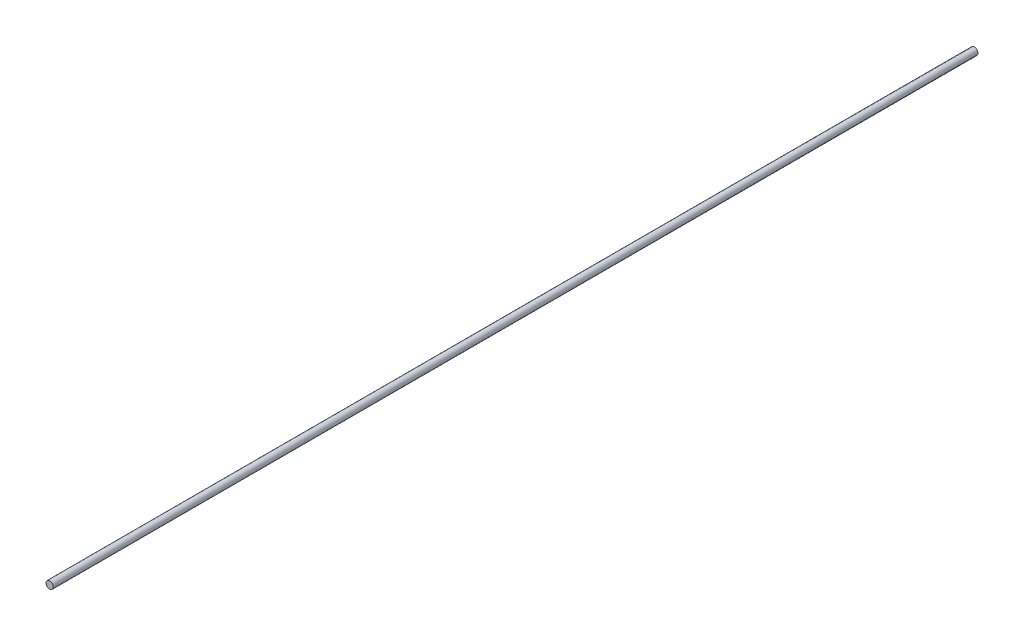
ISO-10303-21;
HEADER;
FILE_DESCRIPTION(('STEP AP214'),'2;1');
FILE_NAME('part.step','',(''),(''),'','','');
FILE_SCHEMA(('AUTOMOTIVE_DESIGN { 1 0 10303 214 1 1 1 1 }'));
ENDSEC;
DATA;
#1=APPLICATION_CONTEXT('core data for automotive mechanical design processes');
#2=APPLICATION_PROTOCOL_DEFINITION('international standard','automotive_design',2000,#1);
#3=PRODUCT_CONTEXT('',#1,'mechanical');
#4=PRODUCT('Part','Part','',(#3));
#5=PRODUCT_RELATED_PRODUCT_CATEGORY('part','',(#4));
#6=PRODUCT_DEFINITION_FORMATION('','',#4);
#7=PRODUCT_DEFINITION_CONTEXT('part definition',#1,'design');
#8=PRODUCT_DEFINITION('design','',#6,#7);
#9=PRODUCT_DEFINITION_SHAPE('','',#8);
#10=(LENGTH_UNIT() NAMED_UNIT(*) SI_UNIT(.MILLI.,.METRE.));
#11=(NAMED_UNIT(*) PLANE_ANGLE_UNIT() SI_UNIT($,.RADIAN.));
#12=(NAMED_UNIT(*) SI_UNIT($,.STERADIAN.) SOLID_ANGLE_UNIT());
#13=UNCERTAINTY_MEASURE_WITH_UNIT(LENGTH_MEASURE(1.E-05),#10,'distance_accuracy_value','');
#14=(GEOMETRIC_REPRESENTATION_CONTEXT(3) GLOBAL_UNCERTAINTY_ASSIGNED_CONTEXT((#13)) GLOBAL_UNIT_ASSIGNED_CONTEXT((#10,
#11,#12)) REPRESENTATION_CONTEXT('',''));
#15=CARTESIAN_POINT('',(0.,0.,0.));
#16=DIRECTION('',(0.,0.,1.));
#17=DIRECTION('',(1.,0.,0.));
#18=AXIS2_PLACEMENT_3D('',#15,#16,#17);
#19=CARTESIAN_POINT('',(0.,0.,1219.2));
#20=DIRECTION('',(0.,0.,-1.));
#21=DIRECTION('',(-1.,0.,0.));
#22=AXIS2_PLACEMENT_3D('',#19,#20,#21);
#23=CYLINDRICAL_SURFACE('',#22,4.7625);
#24=CARTESIAN_POINT('',(0.,0.,1219.2));
#25=DIRECTION('',(0.,0.,1.));
#26=DIRECTION('',(1.,0.,0.));
#27=AXIS2_PLACEMENT_3D('',#24,#25,#26);
#28=CIRCLE('',#27,4.7625);
#29=CARTESIAN_POINT('',(-4.7625,0.,1219.2));
#30=VERTEX_POINT('',#29);
#31=EDGE_CURVE('E12',#30,#30,#28,.T.);
#32=CARTESIAN_POINT('',(0.,0.,0.));
#33=DIRECTION('',(0.,0.,1.));
#34=DIRECTION('',(1.,0.,0.));
#35=AXIS2_PLACEMENT_3D('',#32,#33,#34);
#36=CIRCLE('',#35,4.7625);
#37=CARTESIAN_POINT('',(-4.7625,0.,0.));
#38=VERTEX_POINT('',#37);
#39=EDGE_CURVE('E43',#38,#38,#36,.T.);
#40=CARTESIAN_POINT('',(-4.7625,0.,1219.2));
#41=CARTESIAN_POINT('',(-4.7625,0.,1206.5));
#42=CARTESIAN_POINT('',(-4.7625,0.,1193.8));
#43=CARTESIAN_POINT('',(-4.7625,0.,1168.4));
#44=CARTESIAN_POINT('',(-4.7625,0.,1155.7));
#45=CARTESIAN_POINT('',(-4.7625,0.,1130.3));
#46=CARTESIAN_POINT('',(-4.7625,0.,1117.6));
#47=CARTESIAN_POINT('',(-4.7625,0.,1092.2));
#48=CARTESIAN_POINT('',(-4.7625,0.,1079.5));
#49=CARTESIAN_POINT('',(-4.7625,0.,1054.1));
#50=CARTESIAN_POINT('',(-4.7625,0.,1041.4));
#51=CARTESIAN_POINT('',(-4.7625,0.,1016.));
#52=CARTESIAN_POINT('',(-4.7625,0.,1003.3));
#53=CARTESIAN_POINT('',(-4.7625,0.,977.9));
#54=CARTESIAN_POINT('',(-4.7625,0.,965.2));
#55=CARTESIAN_POINT('',(-4.7625,0.,939.8));
#56=CARTESIAN_POINT('',(-4.7625,0.,927.1));
#57=CARTESIAN_POINT('',(-4.7625,0.,901.7));
#58=CARTESIAN_POINT('',(-4.7625,0.,889.));
#59=CARTESIAN_POINT('',(-4.7625,0.,863.6));
#60=CARTESIAN_POINT('',(-4.7625,0.,850.9));
#61=CARTESIAN_POINT('',(-4.7625,0.,825.5));
#62=CARTESIAN_POINT('',(-4.7625,0.,812.8));
#63=CARTESIAN_POINT('',(-4.7625,0.,787.4));
#64=CARTESIAN_POINT('',(-4.7625,0.,774.7));
#65=CARTESIAN_POINT('',(-4.7625,0.,749.3));
#66=CARTESIAN_POINT('',(-4.7625,0.,736.6));
#67=CARTESIAN_POINT('',(-4.7625,0.,711.2));
#68=CARTESIAN_POINT('',(-4.7625,0.,698.5));
#69=CARTESIAN_POINT('',(-4.7625,0.,673.1));
#70=CARTESIAN_POINT('',(-4.7625,0.,660.4));
#71=CARTESIAN_POINT('',(-4.7625,0.,635.));
#72=CARTESIAN_POINT('',(-4.7625,0.,622.3));
#73=CARTESIAN_POINT('',(-4.7625,0.,596.9));
#74=CARTESIAN_POINT('',(-4.7625,0.,584.2));
#75=CARTESIAN_POINT('',(-4.7625,0.,558.8));
#76=CARTESIAN_POINT('',(-4.7625,0.,546.1));
#77=CARTESIAN_POINT('',(-4.7625,0.,520.7));
#78=CARTESIAN_POINT('',(-4.7625,0.,508.));
#79=CARTESIAN_POINT('',(-4.7625,0.,482.6));
#80=CARTESIAN_POINT('',(-4.7625,0.,469.9));
#81=CARTESIAN_POINT('',(-4.7625,0.,444.5));
#82=CARTESIAN_POINT('',(-4.7625,0.,431.8));
#83=CARTESIAN_POINT('',(-4.7625,0.,406.4));
#84=CARTESIAN_POINT('',(-4.7625,0.,393.7));
#85=CARTESIAN_POINT('',(-4.7625,0.,368.3));
#86=CARTESIAN_POINT('',(-4.7625,0.,355.6));
#87=CARTESIAN_POINT('',(-4.7625,0.,330.2));
#88=CARTESIAN_POINT('',(-4.7625,0.,317.5));
#89=CARTESIAN_POINT('',(-4.7625,0.,292.1));
#90=CARTESIAN_POINT('',(-4.7625,0.,279.4));
#91=CARTESIAN_POINT('',(-4.7625,0.,254.));
#92=CARTESIAN_POINT('',(-4.7625,0.,241.3));
#93=CARTESIAN_POINT('',(-4.7625,0.,215.9));
#94=CARTESIAN_POINT('',(-4.7625,0.,203.2));
#95=CARTESIAN_POINT('',(-4.7625,0.,177.8));
#96=CARTESIAN_POINT('',(-4.7625,0.,165.1));
#97=CARTESIAN_POINT('',(-4.7625,0.,139.7));
#98=CARTESIAN_POINT('',(-4.7625,0.,127.));
#99=CARTESIAN_POINT('',(-4.7625,0.,101.6));
#100=CARTESIAN_POINT('',(-4.7625,0.,88.9));
#101=CARTESIAN_POINT('',(-4.7625,0.,63.5));
#102=CARTESIAN_POINT('',(-4.7625,0.,50.8));
#103=CARTESIAN_POINT('',(-4.7625,0.,25.4));
#104=CARTESIAN_POINT('',(-4.7625,0.,12.7));
#105=CARTESIAN_POINT('',(-4.7625,0.,0.));
#106=B_SPLINE_CURVE_WITH_KNOTS('',3,(#40,#41,#42,#43,#44,#45,#46,#47,#48,#49,#50,#51,#52,#53,
#54,#55,#56,#57,#58,#59,#60,#61,#62,#63,#64,#65,#66,#67,#68,#69,#70,#71,#72,#73,#74,#75,#76,#77,
#78,#79,#80,#81,#82,#83,#84,#85,#86,#87,#88,#89,#90,#91,#92,#93,#94,#95,#96,#97,#98,#99,#100,
#101,#102,#103,#104,#105),.UNSPECIFIED.,.F.,.F.,(4,2,2,2,2,2,2,2,2,2,2,2,2,2,2,2,2,2,2,2,2,2,2,
2,2,2,2,2,2,2,2,2,4),(0.,38.1,76.2,114.3,152.4,190.5,228.6,266.7,304.8,342.9,381.,419.1,457.2,
495.3,533.4,571.5,609.6,647.7,685.8,723.9,762.,800.1,838.2,876.3,914.4,952.5,990.6,1028.7,
1066.8,1104.9,1143.,1181.1,1219.2),.UNSPECIFIED.);
#107=EDGE_CURVE('BSEAM40',#30,#38,#106,.T.);
#108=ORIENTED_EDGE('',*,*,#31,.F.);
#109=ORIENTED_EDGE('',*,*,#39,.T.);
#110=ORIENTED_EDGE('',*,*,#107,.T.);
#111=ORIENTED_EDGE('',*,*,#107,.F.);
#112=EDGE_LOOP('',(#108,#110,#109,#111));
#113=FACE_BOUND('',#112,.T.);
#114=ADVANCED_FACE('F40',(#113),#23,.T.);
#115=CARTESIAN_POINT('',(0.,0.,1219.2));
#116=DIRECTION('',(0.,0.,1.));
#117=DIRECTION('',(1.,0.,0.));
#118=AXIS2_PLACEMENT_3D('',#115,#116,#117);
#119=PLANE('',#118);
#120=ORIENTED_EDGE('',*,*,#31,.T.);
#121=EDGE_LOOP('',(#120));
#122=FACE_BOUND('',#121,.T.);
#123=ADVANCED_FACE('F55',(#122),#119,.T.);
#124=CARTESIAN_POINT('',(0.,0.,0.));
#125=DIRECTION('',(0.,0.,1.));
#126=DIRECTION('',(1.,0.,0.));
#127=AXIS2_PLACEMENT_3D('',#124,#125,#126);
#128=PLANE('',#127);
#129=ORIENTED_EDGE('',*,*,#39,.F.);
#130=EDGE_LOOP('',(#129));
#131=FACE_BOUND('',#130,.T.);
#132=ADVANCED_FACE('F53',(#131),#128,.F.);
#133=CLOSED_SHELL('',(#114,#123,#132));
#134=MANIFOLD_SOLID_BREP('B2',#133);
#135=ADVANCED_BREP_SHAPE_REPRESENTATION('',(#18,#134),#14);
#136=SHAPE_DEFINITION_REPRESENTATION(#9,#135);
ENDSEC;
END-ISO-10303-21;
